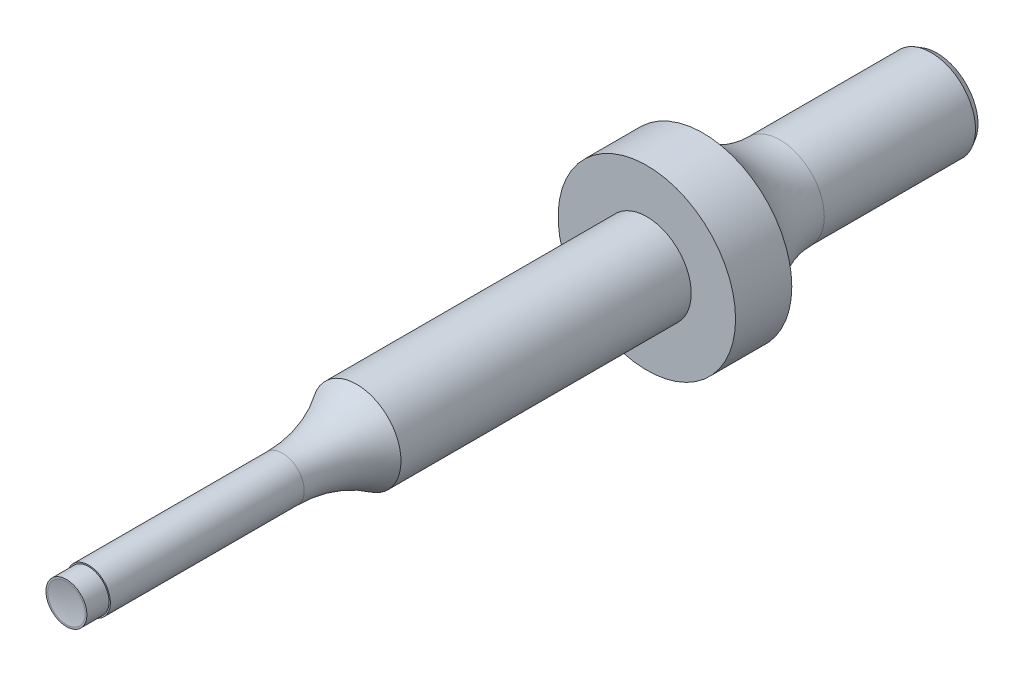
from build123d import *

# Parameters (mm, degrees)
SKETCH1_R           = 5.095
BOSS_EXTRUDE1_DEPTH = 100
SKETCH2_OUTSIDE_W   = 32.396
SKETCH2_OUTSIDE_H   = 32.396
SKETCH2_OUTSIDE_R   = 2.5
CUT_EXTRUDE1_DEPTH  = 33.333333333
SKETCH3_OUTSIDE_W   = 32.396
SKETCH3_OUTSIDE_H   = 32.396
SKETCH3_OUTSIDE_R   = 2.35
CUT_EXTRUDE2_DEPTH  = 2.5475
CHAMFER1_SIZE       = 0.679333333
CHAMFER1_SIZE2      = 0.392213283


with BuildPart() as part:
    # Sketch1 → Boss-Extrude1 (new body)
    with BuildSketch(Plane.XY):
        Circle(SKETCH1_R)
    extrude(amount=-BOSS_EXTRUDE1_DEPTH)

    # Sketch2 outside → Cut-Extrude1 (cut)
    with BuildSketch(Plane.XY):
        Rectangle(SKETCH2_OUTSIDE_W, SKETCH2_OUTSIDE_H)
        Circle(SKETCH2_OUTSIDE_R, mode=Mode.SUBTRACT)
    extrude(amount=-CUT_EXTRUDE1_DEPTH, mode=Mode.SUBTRACT)

    # Sketch3 outside → Cut-Extrude2 (cut)
    with BuildSketch(Plane.XY):
        Rectangle(SKETCH3_OUTSIDE_W, SKETCH3_OUTSIDE_H)
        Circle(SKETCH3_OUTSIDE_R, mode=Mode.SUBTRACT)
    extrude(amount=-CUT_EXTRUDE2_DEPTH, mode=Mode.SUBTRACT)

    # Sketch4 → Cut-Revolve1 (revolve, cut)
    with BuildSketch(Plane(origin=(0, 0, 0), x_dir=(0, 0, -1), z_dir=(1, 0, 0))):
        with BuildLine():
            Line((0, 0), (0, 2.15))
            ThreePointArc((0, 2.15), (0.17188591, 1.081101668), (0.229397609, 0))
            Line((0.229397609, 0), (0, 0))
        make_face()
    revolve(axis=Axis((0, 0, 0), (0, 0, -1)), mode=Mode.SUBTRACT)

    # Chamfer1
    chamfer1_edges = [part.edges().sort_by_distance(p)[0] for p in [
        (-5.095, 0, -100),
    ]]
    chamfer1_side = [part.faces().sort_by_distance(p)[0] for p in [
        (-5.095, 0, -66.666666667),
    ]]
    chamfer(chamfer1_edges, length=CHAMFER1_SIZE, length2=CHAMFER1_SIZE2, reference=chamfer1_side[0])

    # Sketch5 → Revolve1 (revolve)
    with BuildSketch(Plane(origin=(0, 0, 0), x_dir=(0, 0, -1), z_dir=(1, 0, 0)), mode=Mode.PRIVATE) as revolve1_sk:
        with BuildLine():
            Line((33.333333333, 0), (24.813056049, 0))
            Line((24.813056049, 0), (24.813056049, 2.5))
            ThreePointArc((24.813056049, 2.5), (29.266401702, 3.163134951), (33.333333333, 5.095))
            Line((33.333333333, 5.095), (33.333333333, 0))
        make_face()
    revolve(revolve1_sk.sketch.rotate(Axis((0, 0, -33.333333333), (0, 0, 1)), 270), axis=Axis((0, 0, -33.333333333), (0, 0, 1)))

    # Sketch6 → Revolve2 (revolve)
    with BuildSketch(Plane(origin=(0, 0, 0), x_dir=(0, 0, -1), z_dir=(1, 0, 0)), mode=Mode.PRIVATE) as revolve2_sk:
        with BuildLine():
            Line((66.666666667, 0), (81.951666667, 0))
            Line((81.951666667, 0), (81.951666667, 5.095))
            ThreePointArc((81.951666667, 5.095), (76.856666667, 6.460201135), (73.126867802, 10.19))
            Line((73.126867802, 10.19), (66.666666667, 10.19))
            Line((66.666666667, 10.19), (66.666666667, 0))
        make_face()
    revolve(revolve2_sk.sketch.rotate(Axis((0, 0, -66.666666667), (0, 0, -1)), 90), axis=Axis((0, 0, -66.666666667), (0, 0, -1)))


solid = part.part
